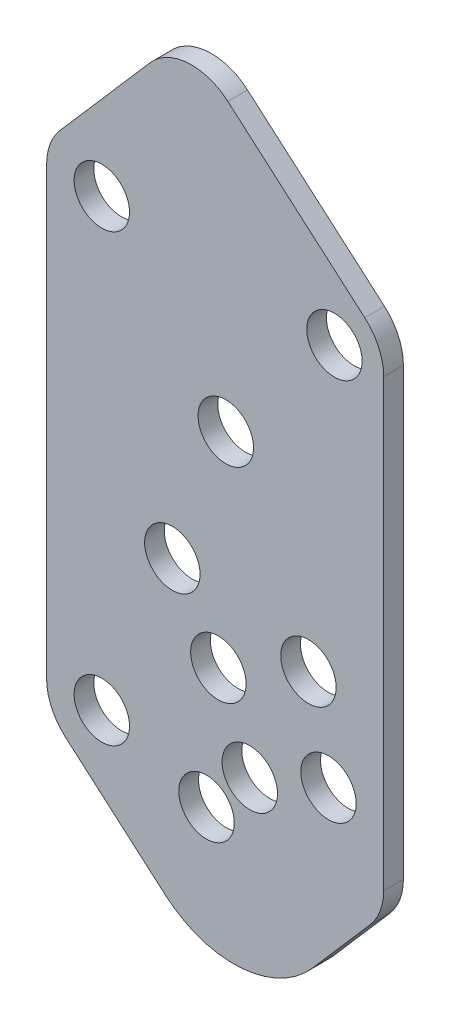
ISO-10303-21;
HEADER;
FILE_DESCRIPTION(('STEP AP214'),'2;1');
FILE_NAME('part.step','',(''),(''),'','','');
FILE_SCHEMA(('AUTOMOTIVE_DESIGN { 1 0 10303 214 1 1 1 1 }'));
ENDSEC;
DATA;
#1=APPLICATION_CONTEXT('core data for automotive mechanical design processes');
#2=APPLICATION_PROTOCOL_DEFINITION('international standard','automotive_design',2000,#1);
#3=PRODUCT_CONTEXT('',#1,'mechanical');
#4=PRODUCT('Part','Part','',(#3));
#5=PRODUCT_RELATED_PRODUCT_CATEGORY('part','',(#4));
#6=PRODUCT_DEFINITION_FORMATION('','',#4);
#7=PRODUCT_DEFINITION_CONTEXT('part definition',#1,'design');
#8=PRODUCT_DEFINITION('design','',#6,#7);
#9=PRODUCT_DEFINITION_SHAPE('','',#8);
#10=(LENGTH_UNIT() NAMED_UNIT(*) SI_UNIT(.MILLI.,.METRE.));
#11=(NAMED_UNIT(*) PLANE_ANGLE_UNIT() SI_UNIT($,.RADIAN.));
#12=(NAMED_UNIT(*) SI_UNIT($,.STERADIAN.) SOLID_ANGLE_UNIT());
#13=UNCERTAINTY_MEASURE_WITH_UNIT(LENGTH_MEASURE(1.E-05),#10,'distance_accuracy_value','');
#14=(GEOMETRIC_REPRESENTATION_CONTEXT(3) GLOBAL_UNCERTAINTY_ASSIGNED_CONTEXT((#13)) GLOBAL_UNIT_ASSIGNED_CONTEXT((#10,
#11,#12)) REPRESENTATION_CONTEXT('',''));
#15=CARTESIAN_POINT('',(0.,0.,0.));
#16=DIRECTION('',(0.,0.,1.));
#17=DIRECTION('',(1.,0.,0.));
#18=AXIS2_PLACEMENT_3D('',#15,#16,#17);
#19=CARTESIAN_POINT('',(-786.638,12.1965232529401,-31.75));
#20=DIRECTION('',(0.,0.,1.));
#21=DIRECTION('',(1.,0.,0.));
#22=AXIS2_PLACEMENT_3D('',#19,#20,#21);
#23=CYLINDRICAL_SURFACE('',#22,7.11200000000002);
#24=CARTESIAN_POINT('',(-786.638,12.1965232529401,-29.21));
#25=DIRECTION('',(0.,0.,1.));
#26=DIRECTION('',(1.,0.,0.));
#27=AXIS2_PLACEMENT_3D('',#24,#25,#26);
#28=CIRCLE('',#27,7.11200000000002);
#29=CARTESIAN_POINT('',(-779.526,12.1965232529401,-29.21));
#30=VERTEX_POINT('',#29);
#31=CARTESIAN_POINT('',(-781.974731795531,17.5662973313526,-29.21));
#32=VERTEX_POINT('',#31);
#33=EDGE_CURVE('E175',#30,#32,#28,.T.);
#34=ORIENTED_EDGE('',*,*,#33,.F.);
#35=DIRECTION('',(0.,0.,1.));
#36=VECTOR('',#35,1.);
#37=CARTESIAN_POINT('',(-779.526,12.1965232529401,-31.75));
#38=LINE('',#37,#36);
#39=CARTESIAN_POINT('',(-779.526,12.1965232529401,-31.75));
#40=VERTEX_POINT('',#39);
#41=EDGE_CURVE('E11',#40,#30,#38,.T.);
#42=ORIENTED_EDGE('',*,*,#41,.F.);
#43=CARTESIAN_POINT('',(-786.638,12.1965232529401,-31.75));
#44=DIRECTION('',(0.,0.,1.));
#45=DIRECTION('',(1.,0.,0.));
#46=AXIS2_PLACEMENT_3D('',#43,#44,#45);
#47=CIRCLE('',#46,7.11200000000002);
#48=CARTESIAN_POINT('',(-781.974731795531,17.5662973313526,-31.75));
#49=VERTEX_POINT('',#48);
#50=EDGE_CURVE('E220',#40,#49,#47,.T.);
#51=ORIENTED_EDGE('',*,*,#50,.T.);
#52=DIRECTION('',(0.,0.,1.));
#53=VECTOR('',#52,1.);
#54=CARTESIAN_POINT('',(-781.974731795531,17.5662973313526,-31.75));
#55=LINE('',#54,#53);
#56=EDGE_CURVE('E50',#49,#32,#55,.T.);
#57=ORIENTED_EDGE('',*,*,#56,.T.);
#58=EDGE_LOOP('',(#34,#42,#51,#57));
#59=FACE_BOUND('',#58,.T.);
#60=ADVANCED_FACE('F47',(#59),#23,.T.);
#61=CARTESIAN_POINT('',(-779.526,-45.1569709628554,-31.75));
#62=DIRECTION('',(1.,0.,0.));
#63=DIRECTION('',(0.,0.,-1.));
#64=AXIS2_PLACEMENT_3D('',#61,#62,#63);
#65=PLANE('',#64);
#66=DIRECTION('',(0.,1.,0.));
#67=VECTOR('',#66,1.);
#68=CARTESIAN_POINT('',(-779.526,-45.1569709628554,-29.21));
#69=LINE('',#68,#67);
#70=CARTESIAN_POINT('',(-779.526,-45.1569709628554,-29.21));
#71=VERTEX_POINT('',#70);
#72=EDGE_CURVE('E217',#71,#30,#69,.T.);
#73=ORIENTED_EDGE('',*,*,#72,.F.);
#74=DIRECTION('',(0.,0.,1.));
#75=VECTOR('',#74,1.);
#76=CARTESIAN_POINT('',(-779.526,-45.1569709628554,-31.75));
#77=LINE('',#76,#75);
#78=CARTESIAN_POINT('',(-779.526,-45.1569709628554,-31.75));
#79=VERTEX_POINT('',#78);
#80=EDGE_CURVE('E57',#79,#71,#77,.T.);
#81=ORIENTED_EDGE('',*,*,#80,.F.);
#82=DIRECTION('',(0.,1.,0.));
#83=VECTOR('',#82,1.);
#84=CARTESIAN_POINT('',(-779.526,-45.1569709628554,-31.75));
#85=LINE('',#84,#83);
#86=EDGE_CURVE('E160',#79,#40,#85,.T.);
#87=ORIENTED_EDGE('',*,*,#86,.T.);
#88=ORIENTED_EDGE('',*,*,#41,.T.);
#89=EDGE_LOOP('',(#73,#81,#87,#88));
#90=FACE_BOUND('',#89,.T.);
#91=ADVANCED_FACE('F252',(#90),#65,.T.);
#92=CARTESIAN_POINT('',(-786.638,-45.1569709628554,-31.75));
#93=DIRECTION('',(0.,0.,1.));
#94=DIRECTION('',(1.,0.,0.));
#95=AXIS2_PLACEMENT_3D('',#92,#93,#94);
#96=CYLINDRICAL_SURFACE('',#95,7.11199999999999);
#97=CARTESIAN_POINT('',(-786.638,-45.1569709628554,-29.21));
#98=DIRECTION('',(0.,0.,1.));
#99=DIRECTION('',(1.,0.,0.));
#100=AXIS2_PLACEMENT_3D('',#97,#98,#99);
#101=CIRCLE('',#100,7.11199999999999);
#102=CARTESIAN_POINT('',(-781.268225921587,-49.820239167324,-29.21));
#103=VERTEX_POINT('',#102);
#104=EDGE_CURVE('E146',#103,#71,#101,.T.);
#105=ORIENTED_EDGE('',*,*,#104,.F.);
#106=DIRECTION('',(0.,0.,1.));
#107=VECTOR('',#106,1.);
#108=CARTESIAN_POINT('',(-781.268225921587,-49.820239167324,-31.75));
#109=LINE('',#108,#107);
#110=CARTESIAN_POINT('',(-781.268225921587,-49.820239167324,-31.75));
#111=VERTEX_POINT('',#110);
#112=EDGE_CURVE('E141',#111,#103,#109,.T.);
#113=ORIENTED_EDGE('',*,*,#112,.F.);
#114=CARTESIAN_POINT('',(-786.638,-45.1569709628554,-31.75));
#115=DIRECTION('',(0.,0.,1.));
#116=DIRECTION('',(1.,0.,0.));
#117=AXIS2_PLACEMENT_3D('',#114,#115,#116);
#118=CIRCLE('',#117,7.11199999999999);
#119=EDGE_CURVE('E144',#111,#79,#118,.T.);
#120=ORIENTED_EDGE('',*,*,#119,.T.);
#121=ORIENTED_EDGE('',*,*,#80,.T.);
#122=EDGE_LOOP('',(#105,#113,#120,#121));
#123=FACE_BOUND('',#122,.T.);
#124=ADVANCED_FACE('F143',(#123),#96,.T.);
#125=CARTESIAN_POINT('',(-788.681711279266,-58.3569005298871,-31.75));
#126=DIRECTION('',(0.75503010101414,-0.655690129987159,0.));
#127=DIRECTION('',(0.655690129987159,0.75503010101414,0.));
#128=AXIS2_PLACEMENT_3D('',#125,#126,#127);
#129=PLANE('',#128);
#130=DIRECTION('',(0.655690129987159,0.75503010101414,0.));
#131=VECTOR('',#130,1.);
#132=CARTESIAN_POINT('',(-788.681711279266,-58.3569005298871,-29.21));
#133=LINE('',#132,#131);
#134=CARTESIAN_POINT('',(-788.681711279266,-58.3569005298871,-29.21));
#135=VERTEX_POINT('',#134);
#136=EDGE_CURVE('E212',#135,#103,#133,.T.);
#137=ORIENTED_EDGE('',*,*,#136,.F.);
#138=DIRECTION('',(0.,0.,1.));
#139=VECTOR('',#138,1.);
#140=CARTESIAN_POINT('',(-788.681711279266,-58.3569005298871,-31.75));
#141=LINE('',#140,#139);
#142=CARTESIAN_POINT('',(-788.681711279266,-58.3569005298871,-31.75));
#143=VERTEX_POINT('',#142);
#144=EDGE_CURVE('E152',#143,#135,#141,.T.);
#145=ORIENTED_EDGE('',*,*,#144,.F.);
#146=DIRECTION('',(0.655690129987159,0.75503010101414,0.));
#147=VECTOR('',#146,1.);
#148=CARTESIAN_POINT('',(-788.681711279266,-58.3569005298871,-31.75));
#149=LINE('',#148,#147);
#150=EDGE_CURVE('E158',#143,#111,#149,.T.);
#151=ORIENTED_EDGE('',*,*,#150,.T.);
#152=ORIENTED_EDGE('',*,*,#112,.T.);
#153=EDGE_LOOP('',(#137,#145,#151,#152));
#154=FACE_BOUND('',#153,.T.);
#155=ADVANCED_FACE('F163',(#154),#129,.T.);
#156=CARTESIAN_POINT('',(-798.845926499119,-49.53,-31.75));
#157=DIRECTION('',(0.,0.,1.));
#158=DIRECTION('',(1.,0.,0.));
#159=AXIS2_PLACEMENT_3D('',#156,#157,#158);
#160=CYLINDRICAL_SURFACE('',#159,13.462);
#161=CARTESIAN_POINT('',(-798.845926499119,-49.53,-29.21));
#162=DIRECTION('',(0.,0.,1.));
#163=DIRECTION('',(1.,0.,0.));
#164=AXIS2_PLACEMENT_3D('',#161,#162,#163);
#165=CIRCLE('',#164,13.462);
#166=CARTESIAN_POINT('',(-807.672827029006,-59.6942152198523,-29.21));
#167=VERTEX_POINT('',#166);
#168=EDGE_CURVE('E208',#167,#135,#165,.T.);
#169=ORIENTED_EDGE('',*,*,#168,.F.);
#170=DIRECTION('',(0.,0.,1.));
#171=VECTOR('',#170,1.);
#172=CARTESIAN_POINT('',(-807.672827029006,-59.6942152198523,-31.75));
#173=LINE('',#172,#171);
#174=CARTESIAN_POINT('',(-807.672827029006,-59.6942152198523,-31.75));
#175=VERTEX_POINT('',#174);
#176=EDGE_CURVE('E226',#175,#167,#173,.T.);
#177=ORIENTED_EDGE('',*,*,#176,.F.);
#178=CARTESIAN_POINT('',(-798.845926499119,-49.53,-31.75));
#179=DIRECTION('',(0.,0.,1.));
#180=DIRECTION('',(1.,0.,0.));
#181=AXIS2_PLACEMENT_3D('',#178,#179,#180);
#182=CIRCLE('',#181,13.462);
#183=EDGE_CURVE('E165',#175,#143,#182,.T.);
#184=ORIENTED_EDGE('',*,*,#183,.T.);
#185=ORIENTED_EDGE('',*,*,#144,.T.);
#186=EDGE_LOOP('',(#169,#177,#184,#185));
#187=FACE_BOUND('',#186,.T.);
#188=ADVANCED_FACE('F265',(#187),#160,.T.);
#189=CARTESIAN_POINT('',(-820.511268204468,-48.54493898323,-31.75));
#190=DIRECTION('',(-0.655690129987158,-0.755030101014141,0.));
#191=DIRECTION('',(0.755030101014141,-0.655690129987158,0.));
#192=AXIS2_PLACEMENT_3D('',#189,#190,#191);
#193=PLANE('',#192);
#194=DIRECTION('',(0.755030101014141,-0.655690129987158,0.));
#195=VECTOR('',#194,1.);
#196=CARTESIAN_POINT('',(-820.511268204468,-48.54493898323,-29.21));
#197=LINE('',#196,#195);
#198=CARTESIAN_POINT('',(-820.511268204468,-48.54493898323,-29.21));
#199=VERTEX_POINT('',#198);
#200=EDGE_CURVE('E204',#199,#167,#197,.T.);
#201=ORIENTED_EDGE('',*,*,#200,.F.);
#202=DIRECTION('',(0.,0.,1.));
#203=VECTOR('',#202,1.);
#204=CARTESIAN_POINT('',(-820.511268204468,-48.54493898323,-31.75));
#205=LINE('',#204,#203);
#206=CARTESIAN_POINT('',(-820.511268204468,-48.54493898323,-31.75));
#207=VERTEX_POINT('',#206);
#208=EDGE_CURVE('E229',#207,#199,#205,.T.);
#209=ORIENTED_EDGE('',*,*,#208,.F.);
#210=DIRECTION('',(0.755030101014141,-0.655690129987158,0.));
#211=VECTOR('',#210,1.);
#212=CARTESIAN_POINT('',(-820.511268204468,-48.54493898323,-31.75));
#213=LINE('',#212,#211);
#214=EDGE_CURVE('E169',#207,#175,#213,.T.);
#215=ORIENTED_EDGE('',*,*,#214,.T.);
#216=ORIENTED_EDGE('',*,*,#176,.T.);
#217=EDGE_LOOP('',(#201,#209,#215,#216));
#218=FACE_BOUND('',#217,.T.);
#219=ADVANCED_FACE('F268',(#218),#193,.T.);
#220=CARTESIAN_POINT('',(-815.848,-43.1751649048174,-31.75));
#221=DIRECTION('',(0.,0.,1.));
#222=DIRECTION('',(1.,0.,0.));
#223=AXIS2_PLACEMENT_3D('',#220,#221,#222);
#224=CYLINDRICAL_SURFACE('',#223,7.11199999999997);
#225=CARTESIAN_POINT('',(-815.848,-43.1751649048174,-29.21));
#226=DIRECTION('',(0.,0.,1.));
#227=DIRECTION('',(1.,0.,0.));
#228=AXIS2_PLACEMENT_3D('',#225,#226,#227);
#229=CIRCLE('',#228,7.11199999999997);
#230=CARTESIAN_POINT('',(-822.96,-43.1751649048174,-29.21));
#231=VERTEX_POINT('',#230);
#232=EDGE_CURVE('E200',#231,#199,#229,.T.);
#233=ORIENTED_EDGE('',*,*,#232,.F.);
#234=DIRECTION('',(0.,0.,1.));
#235=VECTOR('',#234,1.);
#236=CARTESIAN_POINT('',(-822.96,-43.1751649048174,-31.75));
#237=LINE('',#236,#235);
#238=CARTESIAN_POINT('',(-822.96,-43.1751649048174,-31.75));
#239=VERTEX_POINT('',#238);
#240=EDGE_CURVE('E232',#239,#231,#237,.T.);
#241=ORIENTED_EDGE('',*,*,#240,.F.);
#242=CARTESIAN_POINT('',(-815.848,-43.1751649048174,-31.75));
#243=DIRECTION('',(0.,0.,1.));
#244=DIRECTION('',(1.,0.,0.));
#245=AXIS2_PLACEMENT_3D('',#242,#243,#244);
#246=CIRCLE('',#245,7.11199999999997);
#247=EDGE_CURVE('E450',#239,#207,#246,.T.);
#248=ORIENTED_EDGE('',*,*,#247,.T.);
#249=ORIENTED_EDGE('',*,*,#208,.T.);
#250=EDGE_LOOP('',(#233,#241,#248,#249));
#251=FACE_BOUND('',#250,.T.);
#252=ADVANCED_FACE('F272',(#251),#224,.T.);
#253=CARTESIAN_POINT('',(-822.96,14.178329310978,-31.75));
#254=DIRECTION('',(-1.,0.,0.));
#255=DIRECTION('',(0.,0.,1.));
#256=AXIS2_PLACEMENT_3D('',#253,#254,#255);
#257=PLANE('',#256);
#258=DIRECTION('',(0.,-1.,0.));
#259=VECTOR('',#258,1.);
#260=CARTESIAN_POINT('',(-822.96,14.178329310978,-29.21));
#261=LINE('',#260,#259);
#262=CARTESIAN_POINT('',(-822.96,14.178329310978,-29.21));
#263=VERTEX_POINT('',#262);
#264=EDGE_CURVE('E196',#263,#231,#261,.T.);
#265=ORIENTED_EDGE('',*,*,#264,.F.);
#266=DIRECTION('',(0.,0.,1.));
#267=VECTOR('',#266,1.);
#268=CARTESIAN_POINT('',(-822.96,14.178329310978,-31.75));
#269=LINE('',#268,#267);
#270=CARTESIAN_POINT('',(-822.96,14.178329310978,-31.75));
#271=VERTEX_POINT('',#270);
#272=EDGE_CURVE('E235',#271,#263,#269,.T.);
#273=ORIENTED_EDGE('',*,*,#272,.F.);
#274=DIRECTION('',(0.,-1.,0.));
#275=VECTOR('',#274,1.);
#276=CARTESIAN_POINT('',(-822.96,14.178329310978,-31.75));
#277=LINE('',#276,#275);
#278=EDGE_CURVE('E446',#271,#239,#277,.T.);
#279=ORIENTED_EDGE('',*,*,#278,.T.);
#280=ORIENTED_EDGE('',*,*,#240,.T.);
#281=EDGE_LOOP('',(#265,#273,#279,#280));
#282=FACE_BOUND('',#281,.T.);
#283=ADVANCED_FACE('F276',(#282),#257,.T.);
#284=CARTESIAN_POINT('',(-815.848,14.178329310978,-31.75));
#285=DIRECTION('',(0.,0.,1.));
#286=DIRECTION('',(1.,0.,0.));
#287=AXIS2_PLACEMENT_3D('',#284,#285,#286);
#288=CYLINDRICAL_SURFACE('',#287,7.11199999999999);
#289=CARTESIAN_POINT('',(-815.848,14.178329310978,-29.21));
#290=DIRECTION('',(0.,0.,1.));
#291=DIRECTION('',(1.,0.,0.));
#292=AXIS2_PLACEMENT_3D('',#289,#290,#291);
#293=CIRCLE('',#292,7.11199999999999);
#294=CARTESIAN_POINT('',(-821.217774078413,18.8415975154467,-29.21));
#295=VERTEX_POINT('',#294);
#296=EDGE_CURVE('E192',#295,#263,#293,.T.);
#297=ORIENTED_EDGE('',*,*,#296,.F.);
#298=DIRECTION('',(0.,0.,1.));
#299=VECTOR('',#298,1.);
#300=CARTESIAN_POINT('',(-821.217774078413,18.8415975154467,-31.75));
#301=LINE('',#300,#299);
#302=CARTESIAN_POINT('',(-821.217774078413,18.8415975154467,-31.75));
#303=VERTEX_POINT('',#302);
#304=EDGE_CURVE('E238',#303,#295,#301,.T.);
#305=ORIENTED_EDGE('',*,*,#304,.F.);
#306=CARTESIAN_POINT('',(-815.848,14.178329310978,-31.75));
#307=DIRECTION('',(0.,0.,1.));
#308=DIRECTION('',(1.,0.,0.));
#309=AXIS2_PLACEMENT_3D('',#306,#307,#308);
#310=CIRCLE('',#309,7.11199999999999);
#311=EDGE_CURVE('E442',#303,#271,#310,.T.);
#312=ORIENTED_EDGE('',*,*,#311,.T.);
#313=ORIENTED_EDGE('',*,*,#272,.T.);
#314=EDGE_LOOP('',(#297,#305,#312,#313));
#315=FACE_BOUND('',#314,.T.);
#316=ADVANCED_FACE('F280',(#315),#288,.T.);
#317=CARTESIAN_POINT('',(-809.640656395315,32.1727000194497,-31.75));
#318=DIRECTION('',(-0.755030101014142,0.655690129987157,0.));
#319=DIRECTION('',(-0.655690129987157,-0.755030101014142,0.));
#320=AXIS2_PLACEMENT_3D('',#317,#318,#319);
#321=PLANE('',#320);
#322=DIRECTION('',(-0.655690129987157,-0.755030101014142,0.));
#323=VECTOR('',#322,1.);
#324=CARTESIAN_POINT('',(-809.640656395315,32.1727000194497,-29.21));
#325=LINE('',#324,#323);
#326=CARTESIAN_POINT('',(-809.640656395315,32.1727000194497,-29.21));
#327=VERTEX_POINT('',#326);
#328=EDGE_CURVE('E188',#327,#295,#325,.T.);
#329=ORIENTED_EDGE('',*,*,#328,.F.);
#330=DIRECTION('',(0.,0.,1.));
#331=VECTOR('',#330,1.);
#332=CARTESIAN_POINT('',(-809.640656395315,32.1727000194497,-31.75));
#333=LINE('',#332,#331);
#334=CARTESIAN_POINT('',(-809.640656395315,32.1727000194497,-31.75));
#335=VERTEX_POINT('',#334);
#336=EDGE_CURVE('E241',#335,#327,#333,.T.);
#337=ORIENTED_EDGE('',*,*,#336,.F.);
#338=DIRECTION('',(-0.655690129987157,-0.755030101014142,0.));
#339=VECTOR('',#338,1.);
#340=CARTESIAN_POINT('',(-809.640656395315,32.1727000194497,-31.75));
#341=LINE('',#340,#339);
#342=EDGE_CURVE('E438',#335,#303,#341,.T.);
#343=ORIENTED_EDGE('',*,*,#342,.T.);
#344=ORIENTED_EDGE('',*,*,#304,.T.);
#345=EDGE_LOOP('',(#329,#337,#343,#344));
#346=FACE_BOUND('',#345,.T.);
#347=ADVANCED_FACE('F284',(#346),#321,.T.);
#348=CARTESIAN_POINT('',(-804.270882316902,27.509431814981,-31.75));
#349=DIRECTION('',(0.,0.,1.));
#350=DIRECTION('',(1.,0.,0.));
#351=AXIS2_PLACEMENT_3D('',#348,#349,#350);
#352=CYLINDRICAL_SURFACE('',#351,7.11200000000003);
#353=CARTESIAN_POINT('',(-804.270882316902,27.509431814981,-29.21));
#354=DIRECTION('',(0.,0.,1.));
#355=DIRECTION('',(1.,0.,0.));
#356=AXIS2_PLACEMENT_3D('',#353,#354,#355);
#357=CIRCLE('',#356,7.11200000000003);
#358=CARTESIAN_POINT('',(-799.607614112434,32.8792058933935,-29.21));
#359=VERTEX_POINT('',#358);
#360=EDGE_CURVE('E184',#359,#327,#357,.T.);
#361=ORIENTED_EDGE('',*,*,#360,.F.);
#362=DIRECTION('',(0.,0.,1.));
#363=VECTOR('',#362,1.);
#364=CARTESIAN_POINT('',(-799.607614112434,32.8792058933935,-31.75));
#365=LINE('',#364,#363);
#366=CARTESIAN_POINT('',(-799.607614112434,32.8792058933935,-31.75));
#367=VERTEX_POINT('',#366);
#368=EDGE_CURVE('E243',#367,#359,#365,.T.);
#369=ORIENTED_EDGE('',*,*,#368,.F.);
#370=CARTESIAN_POINT('',(-804.270882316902,27.509431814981,-31.75));
#371=DIRECTION('',(0.,0.,1.));
#372=DIRECTION('',(1.,0.,0.));
#373=AXIS2_PLACEMENT_3D('',#370,#371,#372);
#374=CIRCLE('',#373,7.11200000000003);
#375=EDGE_CURVE('E434',#367,#335,#374,.T.);
#376=ORIENTED_EDGE('',*,*,#375,.T.);
#377=ORIENTED_EDGE('',*,*,#336,.T.);
#378=EDGE_LOOP('',(#361,#369,#376,#377));
#379=FACE_BOUND('',#378,.T.);
#380=ADVANCED_FACE('F288',(#379),#352,.T.);
#381=CARTESIAN_POINT('',(-781.974731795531,17.5662973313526,-31.75));
#382=DIRECTION('',(0.65569012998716,0.755030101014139,0.));
#383=DIRECTION('',(-0.755030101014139,0.65569012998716,0.));
#384=AXIS2_PLACEMENT_3D('',#381,#382,#383);
#385=PLANE('',#384);
#386=DIRECTION('',(-0.755030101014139,0.65569012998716,0.));
#387=VECTOR('',#386,1.);
#388=CARTESIAN_POINT('',(-781.974731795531,17.5662973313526,-29.21));
#389=LINE('',#388,#387);
#390=EDGE_CURVE('E179',#32,#359,#389,.T.);
#391=ORIENTED_EDGE('',*,*,#390,.F.);
#392=ORIENTED_EDGE('',*,*,#56,.F.);
#393=DIRECTION('',(-0.755030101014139,0.65569012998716,0.));
#394=VECTOR('',#393,1.);
#395=CARTESIAN_POINT('',(-781.974731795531,17.5662973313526,-31.75));
#396=LINE('',#395,#394);
#397=EDGE_CURVE('E431',#49,#367,#396,.T.);
#398=ORIENTED_EDGE('',*,*,#397,.T.);
#399=ORIENTED_EDGE('',*,*,#368,.T.);
#400=EDGE_LOOP('',(#391,#392,#398,#399));
#401=FACE_BOUND('',#400,.T.);
#402=ADVANCED_FACE('F249',(#401),#385,.T.);
#403=CARTESIAN_POINT('',(-786.638,12.1965232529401,-31.75));
#404=DIRECTION('',(0.,0.,1.));
#405=DIRECTION('',(1.,0.,0.));
#406=AXIS2_PLACEMENT_3D('',#403,#404,#405);
#407=PLANE('',#406);
#408=CARTESIAN_POINT('',(-815.848,14.178329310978,-31.75));
#409=DIRECTION('',(0.,0.,1.));
#410=DIRECTION('',(1.,0.,0.));
#411=AXIS2_PLACEMENT_3D('',#408,#409,#410);
#412=CIRCLE('',#411,3.56869999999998);
#413=CARTESIAN_POINT('',(-812.2793,14.178329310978,-31.75));
#414=VERTEX_POINT('',#413);
#415=EDGE_CURVE('E348',#414,#414,#412,.T.);
#416=ORIENTED_EDGE('',*,*,#415,.T.);
#417=EDGE_LOOP('',(#416));
#418=FACE_BOUND('',#417,.T.);
#419=CARTESIAN_POINT('',(-785.876,12.5440115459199,-31.75));
#420=DIRECTION('',(0.,0.,1.));
#421=DIRECTION('',(1.,0.,0.));
#422=AXIS2_PLACEMENT_3D('',#419,#420,#421);
#423=CIRCLE('',#422,3.56869999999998);
#424=CARTESIAN_POINT('',(-782.3073,12.5440115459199,-31.75));
#425=VERTEX_POINT('',#424);
#426=EDGE_CURVE('E353',#425,#425,#423,.T.);
#427=ORIENTED_EDGE('',*,*,#426,.T.);
#428=EDGE_LOOP('',(#427));
#429=FACE_BOUND('',#428,.T.);
#430=CARTESIAN_POINT('',(-786.638,-37.2194709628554,-31.75));
#431=DIRECTION('',(0.,0.,1.));
#432=DIRECTION('',(1.,0.,0.));
#433=AXIS2_PLACEMENT_3D('',#430,#431,#432);
#434=CIRCLE('',#433,3.56869999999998);
#435=CARTESIAN_POINT('',(-783.0693,-37.2194709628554,-31.75));
#436=VERTEX_POINT('',#435);
#437=EDGE_CURVE('E366',#436,#436,#434,.T.);
#438=ORIENTED_EDGE('',*,*,#437,.T.);
#439=EDGE_LOOP('',(#438));
#440=FACE_BOUND('',#439,.T.);
#441=CARTESIAN_POINT('',(-815.848,-43.1751649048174,-31.75));
#442=DIRECTION('',(0.,0.,1.));
#443=DIRECTION('',(1.,0.,0.));
#444=AXIS2_PLACEMENT_3D('',#441,#442,#443);
#445=CIRCLE('',#444,3.56869999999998);
#446=CARTESIAN_POINT('',(-812.2793,-43.1751649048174,-31.75));
#447=VERTEX_POINT('',#446);
#448=EDGE_CURVE('E374',#447,#447,#445,.T.);
#449=ORIENTED_EDGE('',*,*,#448,.T.);
#450=EDGE_LOOP('',(#449));
#451=FACE_BOUND('',#450,.T.);
#452=CARTESIAN_POINT('',(-800.829795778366,-30.9504062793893,-31.75));
#453=DIRECTION('',(0.,0.,1.));
#454=DIRECTION('',(1.,0.,0.));
#455=AXIS2_PLACEMENT_3D('',#452,#453,#454);
#456=CIRCLE('',#455,3.571875);
#457=CARTESIAN_POINT('',(-797.257920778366,-30.9504062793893,-31.75));
#458=VERTEX_POINT('',#457);
#459=EDGE_CURVE('E382',#458,#458,#456,.T.);
#460=ORIENTED_EDGE('',*,*,#459,.T.);
#461=EDGE_LOOP('',(#460));
#462=FACE_BOUND('',#461,.T.);
#463=CARTESIAN_POINT('',(-799.873146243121,-4.1097131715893,-31.75));
#464=DIRECTION('',(0.,0.,1.));
#465=DIRECTION('',(1.,0.,0.));
#466=AXIS2_PLACEMENT_3D('',#463,#464,#465);
#467=CIRCLE('',#466,3.571875);
#468=CARTESIAN_POINT('',(-796.301271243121,-4.1097131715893,-31.75));
#469=VERTEX_POINT('',#468);
#470=EDGE_CURVE('E390',#469,#469,#467,.T.);
#471=ORIENTED_EDGE('',*,*,#470,.T.);
#472=EDGE_LOOP('',(#471));
#473=FACE_BOUND('',#472,.T.);
#474=CARTESIAN_POINT('',(-806.760388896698,-21.6860625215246,-31.75));
#475=DIRECTION('',(0.,0.,1.));
#476=DIRECTION('',(1.,0.,0.));
#477=AXIS2_PLACEMENT_3D('',#474,#475,#476);
#478=CIRCLE('',#477,3.571875);
#479=CARTESIAN_POINT('',(-803.188513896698,-21.6860625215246,-31.75));
#480=VERTEX_POINT('',#479);
#481=EDGE_CURVE('E398',#480,#480,#478,.T.);
#482=ORIENTED_EDGE('',*,*,#481,.T.);
#483=EDGE_LOOP('',(#482));
#484=FACE_BOUND('',#483,.T.);
#485=CARTESIAN_POINT('',(-789.220778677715,-25.5532134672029,-31.75));
#486=DIRECTION('',(0.,0.,1.));
#487=DIRECTION('',(1.,0.,0.));
#488=AXIS2_PLACEMENT_3D('',#485,#486,#487);
#489=CIRCLE('',#488,3.571875);
#490=CARTESIAN_POINT('',(-785.648903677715,-25.5532134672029,-31.75));
#491=VERTEX_POINT('',#490);
#492=EDGE_CURVE('E406',#491,#491,#489,.T.);
#493=ORIENTED_EDGE('',*,*,#492,.T.);
#494=EDGE_LOOP('',(#493));
#495=FACE_BOUND('',#494,.T.);
#496=CARTESIAN_POINT('',(-796.778000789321,-41.1769872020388,-31.75));
#497=DIRECTION('',(0.,0.,1.));
#498=DIRECTION('',(1.,0.,0.));
#499=AXIS2_PLACEMENT_3D('',#496,#497,#498);
#500=CIRCLE('',#499,3.571875);
#501=CARTESIAN_POINT('',(-793.206125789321,-41.1769872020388,-31.75));
#502=VERTEX_POINT('',#501);
#503=EDGE_CURVE('E414',#502,#502,#500,.T.);
#504=ORIENTED_EDGE('',*,*,#503,.T.);
#505=EDGE_LOOP('',(#504));
#506=FACE_BOUND('',#505,.T.);
#507=CARTESIAN_POINT('',(-802.354782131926,-47.2412554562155,-31.75));
#508=DIRECTION('',(0.,0.,1.));
#509=DIRECTION('',(1.,0.,0.));
#510=AXIS2_PLACEMENT_3D('',#507,#508,#509);
#511=CIRCLE('',#510,3.571875);
#512=CARTESIAN_POINT('',(-798.782907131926,-47.2412554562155,-31.75));
#513=VERTEX_POINT('',#512);
#514=EDGE_CURVE('E422',#513,#513,#511,.T.);
#515=ORIENTED_EDGE('',*,*,#514,.T.);
#516=EDGE_LOOP('',(#515));
#517=FACE_BOUND('',#516,.T.);
#518=ORIENTED_EDGE('',*,*,#50,.F.);
#519=ORIENTED_EDGE('',*,*,#86,.F.);
#520=ORIENTED_EDGE('',*,*,#119,.F.);
#521=ORIENTED_EDGE('',*,*,#150,.F.);
#522=ORIENTED_EDGE('',*,*,#183,.F.);
#523=ORIENTED_EDGE('',*,*,#214,.F.);
#524=ORIENTED_EDGE('',*,*,#247,.F.);
#525=ORIENTED_EDGE('',*,*,#278,.F.);
#526=ORIENTED_EDGE('',*,*,#311,.F.);
#527=ORIENTED_EDGE('',*,*,#342,.F.);
#528=ORIENTED_EDGE('',*,*,#375,.F.);
#529=ORIENTED_EDGE('',*,*,#397,.F.);
#530=EDGE_LOOP('',(#518,#519,#520,#521,#522,#523,#524,#525,#526,#527,#528,#529));
#531=FACE_BOUND('',#530,.T.);
#532=ADVANCED_FACE('F156',(#418,#429,#440,#451,#462,#473,#484,#495,#506,#517,#531),#407,.F.);
#533=CARTESIAN_POINT('',(-786.638,12.1965232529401,-29.21));
#534=DIRECTION('',(0.,0.,1.));
#535=DIRECTION('',(1.,0.,0.));
#536=AXIS2_PLACEMENT_3D('',#533,#534,#535);
#537=PLANE('',#536);
#538=CARTESIAN_POINT('',(-815.848,14.178329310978,-29.21));
#539=DIRECTION('',(0.,0.,1.));
#540=DIRECTION('',(1.,0.,0.));
#541=AXIS2_PLACEMENT_3D('',#538,#539,#540);
#542=CIRCLE('',#541,3.56869999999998);
#543=CARTESIAN_POINT('',(-812.2793,14.178329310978,-29.21));
#544=VERTEX_POINT('',#543);
#545=EDGE_CURVE('E351',#544,#544,#542,.T.);
#546=ORIENTED_EDGE('',*,*,#545,.F.);
#547=EDGE_LOOP('',(#546));
#548=FACE_BOUND('',#547,.T.);
#549=CARTESIAN_POINT('',(-785.876,12.5440115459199,-29.21));
#550=DIRECTION('',(0.,0.,1.));
#551=DIRECTION('',(1.,0.,0.));
#552=AXIS2_PLACEMENT_3D('',#549,#550,#551);
#553=CIRCLE('',#552,3.56869999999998);
#554=CARTESIAN_POINT('',(-782.3073,12.5440115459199,-29.21));
#555=VERTEX_POINT('',#554);
#556=EDGE_CURVE('E359',#555,#555,#553,.T.);
#557=ORIENTED_EDGE('',*,*,#556,.F.);
#558=EDGE_LOOP('',(#557));
#559=FACE_BOUND('',#558,.T.);
#560=CARTESIAN_POINT('',(-786.638,-37.2194709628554,-29.21));
#561=DIRECTION('',(0.,0.,1.));
#562=DIRECTION('',(1.,0.,0.));
#563=AXIS2_PLACEMENT_3D('',#560,#561,#562);
#564=CIRCLE('',#563,3.56869999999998);
#565=CARTESIAN_POINT('',(-783.0693,-37.2194709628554,-29.21));
#566=VERTEX_POINT('',#565);
#567=EDGE_CURVE('E370',#566,#566,#564,.T.);
#568=ORIENTED_EDGE('',*,*,#567,.F.);
#569=EDGE_LOOP('',(#568));
#570=FACE_BOUND('',#569,.T.);
#571=CARTESIAN_POINT('',(-815.848,-43.1751649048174,-29.21));
#572=DIRECTION('',(0.,0.,1.));
#573=DIRECTION('',(1.,0.,0.));
#574=AXIS2_PLACEMENT_3D('',#571,#572,#573);
#575=CIRCLE('',#574,3.56869999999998);
#576=CARTESIAN_POINT('',(-812.2793,-43.1751649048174,-29.21));
#577=VERTEX_POINT('',#576);
#578=EDGE_CURVE('E378',#577,#577,#575,.T.);
#579=ORIENTED_EDGE('',*,*,#578,.F.);
#580=EDGE_LOOP('',(#579));
#581=FACE_BOUND('',#580,.T.);
#582=CARTESIAN_POINT('',(-800.829795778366,-30.9504062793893,-29.21));
#583=DIRECTION('',(0.,0.,1.));
#584=DIRECTION('',(1.,0.,0.));
#585=AXIS2_PLACEMENT_3D('',#582,#583,#584);
#586=CIRCLE('',#585,3.571875);
#587=CARTESIAN_POINT('',(-797.257920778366,-30.9504062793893,-29.21));
#588=VERTEX_POINT('',#587);
#589=EDGE_CURVE('E386',#588,#588,#586,.T.);
#590=ORIENTED_EDGE('',*,*,#589,.F.);
#591=EDGE_LOOP('',(#590));
#592=FACE_BOUND('',#591,.T.);
#593=CARTESIAN_POINT('',(-799.873146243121,-4.1097131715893,-29.21));
#594=DIRECTION('',(0.,0.,1.));
#595=DIRECTION('',(1.,0.,0.));
#596=AXIS2_PLACEMENT_3D('',#593,#594,#595);
#597=CIRCLE('',#596,3.571875);
#598=CARTESIAN_POINT('',(-796.301271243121,-4.1097131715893,-29.21));
#599=VERTEX_POINT('',#598);
#600=EDGE_CURVE('E394',#599,#599,#597,.T.);
#601=ORIENTED_EDGE('',*,*,#600,.F.);
#602=EDGE_LOOP('',(#601));
#603=FACE_BOUND('',#602,.T.);
#604=CARTESIAN_POINT('',(-806.760388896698,-21.6860625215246,-29.21));
#605=DIRECTION('',(0.,0.,1.));
#606=DIRECTION('',(1.,0.,0.));
#607=AXIS2_PLACEMENT_3D('',#604,#605,#606);
#608=CIRCLE('',#607,3.571875);
#609=CARTESIAN_POINT('',(-803.188513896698,-21.6860625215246,-29.21));
#610=VERTEX_POINT('',#609);
#611=EDGE_CURVE('E402',#610,#610,#608,.T.);
#612=ORIENTED_EDGE('',*,*,#611,.F.);
#613=EDGE_LOOP('',(#612));
#614=FACE_BOUND('',#613,.T.);
#615=CARTESIAN_POINT('',(-789.220778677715,-25.5532134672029,-29.21));
#616=DIRECTION('',(0.,0.,1.));
#617=DIRECTION('',(1.,0.,0.));
#618=AXIS2_PLACEMENT_3D('',#615,#616,#617);
#619=CIRCLE('',#618,3.571875);
#620=CARTESIAN_POINT('',(-785.648903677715,-25.5532134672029,-29.21));
#621=VERTEX_POINT('',#620);
#622=EDGE_CURVE('E410',#621,#621,#619,.T.);
#623=ORIENTED_EDGE('',*,*,#622,.F.);
#624=EDGE_LOOP('',(#623));
#625=FACE_BOUND('',#624,.T.);
#626=CARTESIAN_POINT('',(-796.778000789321,-41.1769872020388,-29.21));
#627=DIRECTION('',(0.,0.,1.));
#628=DIRECTION('',(1.,0.,0.));
#629=AXIS2_PLACEMENT_3D('',#626,#627,#628);
#630=CIRCLE('',#629,3.571875);
#631=CARTESIAN_POINT('',(-793.206125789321,-41.1769872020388,-29.21));
#632=VERTEX_POINT('',#631);
#633=EDGE_CURVE('E418',#632,#632,#630,.T.);
#634=ORIENTED_EDGE('',*,*,#633,.F.);
#635=EDGE_LOOP('',(#634));
#636=FACE_BOUND('',#635,.T.);
#637=CARTESIAN_POINT('',(-802.354782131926,-47.2412554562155,-29.21));
#638=DIRECTION('',(0.,0.,1.));
#639=DIRECTION('',(1.,0.,0.));
#640=AXIS2_PLACEMENT_3D('',#637,#638,#639);
#641=CIRCLE('',#640,3.571875);
#642=CARTESIAN_POINT('',(-798.782907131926,-47.2412554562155,-29.21));
#643=VERTEX_POINT('',#642);
#644=EDGE_CURVE('E180',#643,#643,#641,.T.);
#645=ORIENTED_EDGE('',*,*,#644,.F.);
#646=EDGE_LOOP('',(#645));
#647=FACE_BOUND('',#646,.T.);
#648=ORIENTED_EDGE('',*,*,#33,.T.);
#649=ORIENTED_EDGE('',*,*,#390,.T.);
#650=ORIENTED_EDGE('',*,*,#360,.T.);
#651=ORIENTED_EDGE('',*,*,#328,.T.);
#652=ORIENTED_EDGE('',*,*,#296,.T.);
#653=ORIENTED_EDGE('',*,*,#264,.T.);
#654=ORIENTED_EDGE('',*,*,#232,.T.);
#655=ORIENTED_EDGE('',*,*,#200,.T.);
#656=ORIENTED_EDGE('',*,*,#168,.T.);
#657=ORIENTED_EDGE('',*,*,#136,.T.);
#658=ORIENTED_EDGE('',*,*,#104,.T.);
#659=ORIENTED_EDGE('',*,*,#72,.T.);
#660=EDGE_LOOP('',(#648,#649,#650,#651,#652,#653,#654,#655,#656,#657,#658,#659));
#661=FACE_BOUND('',#660,.T.);
#662=ADVANCED_FACE('F251',(#548,#559,#570,#581,#592,#603,#614,#625,#636,#647,#661),#537,.T.);
#663=CARTESIAN_POINT('',(-802.354782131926,-47.2412554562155,-29.21));
#664=DIRECTION('',(0.,0.,1.));
#665=DIRECTION('',(1.,0.,0.));
#666=AXIS2_PLACEMENT_3D('',#663,#664,#665);
#667=CYLINDRICAL_SURFACE('',#666,3.571875);
#668=ORIENTED_EDGE('',*,*,#514,.F.);
#669=EDGE_LOOP('',(#668));
#670=FACE_BOUND('',#669,.T.);
#671=ORIENTED_EDGE('',*,*,#644,.T.);
#672=EDGE_LOOP('',(#671));
#673=FACE_BOUND('',#672,.T.);
#674=ADVANCED_FACE('F302',(#670,#673),#667,.F.);
#675=CARTESIAN_POINT('',(-796.778000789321,-41.1769872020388,-29.21));
#676=DIRECTION('',(0.,0.,1.));
#677=DIRECTION('',(1.,0.,0.));
#678=AXIS2_PLACEMENT_3D('',#675,#676,#677);
#679=CYLINDRICAL_SURFACE('',#678,3.571875);
#680=ORIENTED_EDGE('',*,*,#503,.F.);
#681=EDGE_LOOP('',(#680));
#682=FACE_BOUND('',#681,.T.);
#683=ORIENTED_EDGE('',*,*,#633,.T.);
#684=EDGE_LOOP('',(#683));
#685=FACE_BOUND('',#684,.T.);
#686=ADVANCED_FACE('F308',(#682,#685),#679,.F.);
#687=CARTESIAN_POINT('',(-789.220778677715,-25.5532134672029,-29.21));
#688=DIRECTION('',(0.,0.,1.));
#689=DIRECTION('',(1.,0.,0.));
#690=AXIS2_PLACEMENT_3D('',#687,#688,#689);
#691=CYLINDRICAL_SURFACE('',#690,3.571875);
#692=ORIENTED_EDGE('',*,*,#492,.F.);
#693=EDGE_LOOP('',(#692));
#694=FACE_BOUND('',#693,.T.);
#695=ORIENTED_EDGE('',*,*,#622,.T.);
#696=EDGE_LOOP('',(#695));
#697=FACE_BOUND('',#696,.T.);
#698=ADVANCED_FACE('F312',(#694,#697),#691,.F.);
#699=CARTESIAN_POINT('',(-806.760388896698,-21.6860625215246,-29.21));
#700=DIRECTION('',(0.,0.,1.));
#701=DIRECTION('',(1.,0.,0.));
#702=AXIS2_PLACEMENT_3D('',#699,#700,#701);
#703=CYLINDRICAL_SURFACE('',#702,3.571875);
#704=ORIENTED_EDGE('',*,*,#481,.F.);
#705=EDGE_LOOP('',(#704));
#706=FACE_BOUND('',#705,.T.);
#707=ORIENTED_EDGE('',*,*,#611,.T.);
#708=EDGE_LOOP('',(#707));
#709=FACE_BOUND('',#708,.T.);
#710=ADVANCED_FACE('F316',(#706,#709),#703,.F.);
#711=CARTESIAN_POINT('',(-799.873146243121,-4.1097131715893,-29.21));
#712=DIRECTION('',(0.,0.,1.));
#713=DIRECTION('',(1.,0.,0.));
#714=AXIS2_PLACEMENT_3D('',#711,#712,#713);
#715=CYLINDRICAL_SURFACE('',#714,3.571875);
#716=ORIENTED_EDGE('',*,*,#470,.F.);
#717=EDGE_LOOP('',(#716));
#718=FACE_BOUND('',#717,.T.);
#719=ORIENTED_EDGE('',*,*,#600,.T.);
#720=EDGE_LOOP('',(#719));
#721=FACE_BOUND('',#720,.T.);
#722=ADVANCED_FACE('F320',(#718,#721),#715,.F.);
#723=CARTESIAN_POINT('',(-800.829795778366,-30.9504062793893,-29.21));
#724=DIRECTION('',(0.,0.,1.));
#725=DIRECTION('',(1.,0.,0.));
#726=AXIS2_PLACEMENT_3D('',#723,#724,#725);
#727=CYLINDRICAL_SURFACE('',#726,3.571875);
#728=ORIENTED_EDGE('',*,*,#459,.F.);
#729=EDGE_LOOP('',(#728));
#730=FACE_BOUND('',#729,.T.);
#731=ORIENTED_EDGE('',*,*,#589,.T.);
#732=EDGE_LOOP('',(#731));
#733=FACE_BOUND('',#732,.T.);
#734=ADVANCED_FACE('F324',(#730,#733),#727,.F.);
#735=CARTESIAN_POINT('',(-815.848,-43.1751649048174,-29.21));
#736=DIRECTION('',(0.,0.,1.));
#737=DIRECTION('',(1.,0.,0.));
#738=AXIS2_PLACEMENT_3D('',#735,#736,#737);
#739=CYLINDRICAL_SURFACE('',#738,3.56869999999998);
#740=ORIENTED_EDGE('',*,*,#448,.F.);
#741=EDGE_LOOP('',(#740));
#742=FACE_BOUND('',#741,.T.);
#743=ORIENTED_EDGE('',*,*,#578,.T.);
#744=EDGE_LOOP('',(#743));
#745=FACE_BOUND('',#744,.T.);
#746=ADVANCED_FACE('F328',(#742,#745),#739,.F.);
#747=CARTESIAN_POINT('',(-786.638,-37.2194709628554,-29.21));
#748=DIRECTION('',(0.,0.,1.));
#749=DIRECTION('',(1.,0.,0.));
#750=AXIS2_PLACEMENT_3D('',#747,#748,#749);
#751=CYLINDRICAL_SURFACE('',#750,3.56869999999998);
#752=ORIENTED_EDGE('',*,*,#437,.F.);
#753=EDGE_LOOP('',(#752));
#754=FACE_BOUND('',#753,.T.);
#755=ORIENTED_EDGE('',*,*,#567,.T.);
#756=EDGE_LOOP('',(#755));
#757=FACE_BOUND('',#756,.T.);
#758=ADVANCED_FACE('F332',(#754,#757),#751,.F.);
#759=CARTESIAN_POINT('',(-785.876,12.5440115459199,-29.21));
#760=DIRECTION('',(0.,0.,1.));
#761=DIRECTION('',(1.,0.,0.));
#762=AXIS2_PLACEMENT_3D('',#759,#760,#761);
#763=CYLINDRICAL_SURFACE('',#762,3.56869999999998);
#764=ORIENTED_EDGE('',*,*,#426,.F.);
#765=EDGE_LOOP('',(#764));
#766=FACE_BOUND('',#765,.T.);
#767=ORIENTED_EDGE('',*,*,#556,.T.);
#768=EDGE_LOOP('',(#767));
#769=FACE_BOUND('',#768,.T.);
#770=ADVANCED_FACE('F336',(#766,#769),#763,.F.);
#771=CARTESIAN_POINT('',(-815.848,14.178329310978,-29.21));
#772=DIRECTION('',(0.,0.,1.));
#773=DIRECTION('',(1.,0.,0.));
#774=AXIS2_PLACEMENT_3D('',#771,#772,#773);
#775=CYLINDRICAL_SURFACE('',#774,3.56869999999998);
#776=ORIENTED_EDGE('',*,*,#415,.F.);
#777=EDGE_LOOP('',(#776));
#778=FACE_BOUND('',#777,.T.);
#779=ORIENTED_EDGE('',*,*,#545,.T.);
#780=EDGE_LOOP('',(#779));
#781=FACE_BOUND('',#780,.T.);
#782=ADVANCED_FACE('F340',(#778,#781),#775,.F.);
#783=CLOSED_SHELL('',(#60,#91,#124,#155,#188,#219,#252,#283,#316,#347,#380,#402,#532,#662,#674,
#686,#698,#710,#722,#734,#746,#758,#770,#782));
#784=MANIFOLD_SOLID_BREP('B2',#783);
#785=ADVANCED_BREP_SHAPE_REPRESENTATION('',(#18,#784),#14);
#786=SHAPE_DEFINITION_REPRESENTATION(#9,#785);
ENDSEC;
END-ISO-10303-21;
